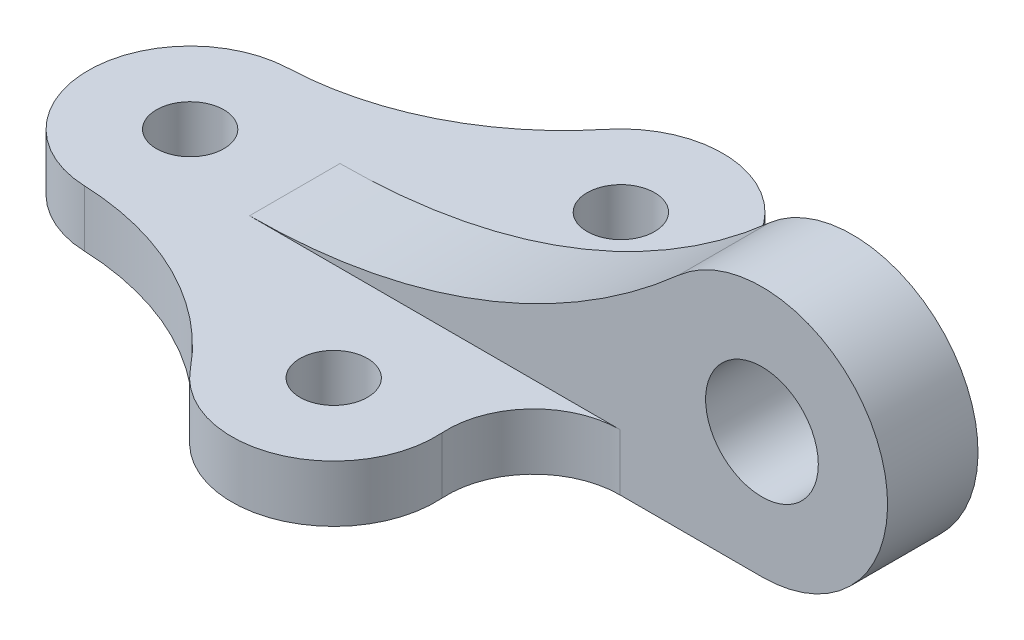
from build123d import *

# Parameters (mm, degrees)
SKETCH1_R           = 5.969
BOSS_EXTRUDE3_DEPTH = 10.0076
SKETCH5_R           = 9.9695
BOSS_EXTRUDE4_DEPTH = 8.001


with BuildPart() as part:
    # Sketch1 → Boss-Extrude3 (new body)
    with BuildSketch(Plane(origin=(0, 0, 0), x_dir=(1, 0, 0), z_dir=(0, 1, 0))):
        with BuildLine():
            Line((84.003882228, 8.001), (84.003882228, 0))
            Line((84.003882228, 0), (84.003882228, -8.001))
            ThreePointArc((84.003882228, -8.001), (72.88345621, -12.82016869), (68.795997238, -24.229854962))
            ThreePointArc((68.795997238, -24.229854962), (57.378658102, -42.191260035), (36.798683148, -36.76610234))
            ThreePointArc((36.798683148, -36.76610234), (20.076804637, -23.346390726), (-0.69209176, -18.020714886))
            ThreePointArc((-0.69209176, -18.020714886), (-18.034, 0), (-0.69209176, 18.020714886))
            ThreePointArc((-0.69209176, 18.020714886), (20.076804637, 23.346390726), (36.798683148, 36.76610234))
            ThreePointArc((36.798683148, 36.76610234), (57.378658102, 42.191260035), (68.795997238, 24.229854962))
            ThreePointArc((68.795997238, 24.229854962), (72.88345621, 12.82016869), (84.003882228, 8.001))
        make_face()
        with Locations(Location((0, 0, 0), (0, 0, 270))):
            Circle(SKETCH1_R, mode=Mode.SUBTRACT)
        with Locations(Location((50.8, 25.4, 0), (0, 0, 270))):
            Circle(SKETCH1_R, mode=Mode.SUBTRACT)
        with Locations(Location((50.8, -25.4, 0), (0, 0, 270))):
            Circle(SKETCH1_R, mode=Mode.SUBTRACT)
    extrude(amount=BOSS_EXTRUDE3_DEPTH)

    # Sketch5 → Boss-Extrude4 (add, symmetric)
    with BuildSketch(Plane.XY):
        with BuildLine():
            Line((109.16290824, 0), (18.508518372, 0))
            Line((18.508518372, 0), (18.508518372, 10.0076))
            ThreePointArc((18.508518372, 10.0076), (59.103452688, 17.459383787), (94.405216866, 38.843097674))
            ThreePointArc((94.405216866, 38.843097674), (129.938950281, 30.11845945), (109.16290824, 0))
        make_face()
        with Locations((109.16290824, 22.225)):
            Circle(SKETCH5_R, mode=Mode.SUBTRACT)
    extrude(amount=BOSS_EXTRUDE4_DEPTH, both=True)


solid = part.part
